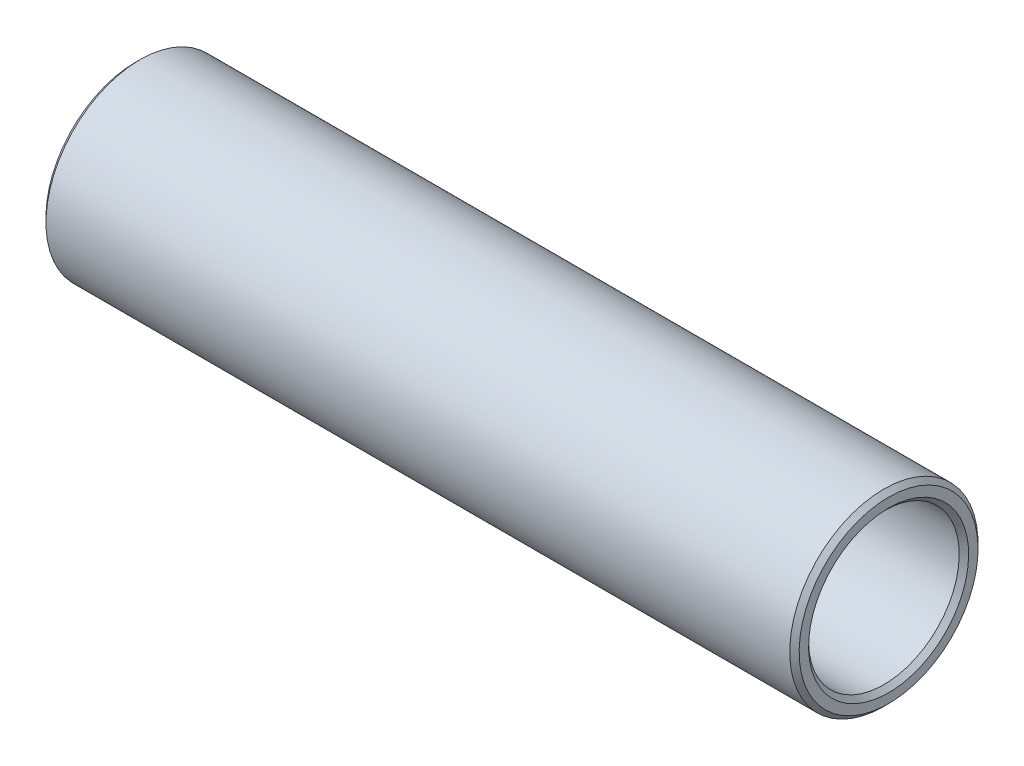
ISO-10303-21;
HEADER;
FILE_DESCRIPTION(('STEP AP214'),'2;1');
FILE_NAME('part.step','',(''),(''),'','','');
FILE_SCHEMA(('AUTOMOTIVE_DESIGN { 1 0 10303 214 1 1 1 1 }'));
ENDSEC;
DATA;
#1=APPLICATION_CONTEXT('core data for automotive mechanical design processes');
#2=APPLICATION_PROTOCOL_DEFINITION('international standard','automotive_design',2000,#1);
#3=PRODUCT_CONTEXT('',#1,'mechanical');
#4=PRODUCT('Part','Part','',(#3));
#5=PRODUCT_RELATED_PRODUCT_CATEGORY('part','',(#4));
#6=PRODUCT_DEFINITION_FORMATION('','',#4);
#7=PRODUCT_DEFINITION_CONTEXT('part definition',#1,'design');
#8=PRODUCT_DEFINITION('design','',#6,#7);
#9=PRODUCT_DEFINITION_SHAPE('','',#8);
#10=(LENGTH_UNIT() NAMED_UNIT(*) SI_UNIT(.MILLI.,.METRE.));
#11=(NAMED_UNIT(*) PLANE_ANGLE_UNIT() SI_UNIT($,.RADIAN.));
#12=(NAMED_UNIT(*) SI_UNIT($,.STERADIAN.) SOLID_ANGLE_UNIT());
#13=UNCERTAINTY_MEASURE_WITH_UNIT(LENGTH_MEASURE(1.E-05),#10,'distance_accuracy_value','');
#14=(GEOMETRIC_REPRESENTATION_CONTEXT(3) GLOBAL_UNCERTAINTY_ASSIGNED_CONTEXT((#13)) GLOBAL_UNIT_ASSIGNED_CONTEXT((#10,
#11,#12)) REPRESENTATION_CONTEXT('',''));
#15=CARTESIAN_POINT('',(0.,0.,0.));
#16=DIRECTION('',(0.,0.,1.));
#17=DIRECTION('',(1.,0.,0.));
#18=AXIS2_PLACEMENT_3D('',#15,#16,#17);
#19=CARTESIAN_POINT('',(10.3441887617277,2.,0.));
#20=DIRECTION('',(1.,0.,0.));
#21=DIRECTION('',(0.,0.,-1.));
#22=AXIS2_PLACEMENT_3D('',#19,#20,#21);
#23=PLANE('',#22);
#24=CARTESIAN_POINT('',(10.3441887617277,0.,0.));
#25=DIRECTION('',(-1.,0.,0.));
#26=DIRECTION('',(0.,0.,-1.));
#27=AXIS2_PLACEMENT_3D('',#24,#25,#26);
#28=CIRCLE('',#27,3.4);
#29=CARTESIAN_POINT('',(10.3441887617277,0.,-3.4));
#30=VERTEX_POINT('',#29);
#31=EDGE_CURVE('E9',#30,#30,#28,.T.);
#32=ORIENTED_EDGE('',*,*,#31,.T.);
#33=EDGE_LOOP('',(#32));
#34=FACE_BOUND('',#33,.T.);
#35=DIRECTION('',(0.,0.,-1.));
#36=VECTOR('',#35,1.);
#37=CARTESIAN_POINT('',(10.3441887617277,0.,-1.9875));
#38=LINE('',#37,#36);
#39=CARTESIAN_POINT('',(10.3441887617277,0.,-3.94999999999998));
#40=VERTEX_POINT('',#39);
#41=CARTESIAN_POINT('',(10.3441887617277,0.,-3.99999999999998));
#42=VERTEX_POINT('',#41);
#43=EDGE_CURVE('E25',#40,#42,#38,.T.);
#44=ORIENTED_EDGE('',*,*,#43,.T.);
#45=CARTESIAN_POINT('',(10.3441887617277,0.,0.));
#46=DIRECTION('',(1.,0.,0.));
#47=DIRECTION('',(0.,1.,0.));
#48=AXIS2_PLACEMENT_3D('',#45,#46,#47);
#49=CIRCLE('',#48,4.);
#50=CARTESIAN_POINT('',(10.3441887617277,4.00000000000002,0.));
#51=VERTEX_POINT('',#50);
#52=EDGE_CURVE('E100',#42,#51,#49,.T.);
#53=ORIENTED_EDGE('',*,*,#52,.T.);
#54=DIRECTION('',(0.,-1.,0.));
#55=VECTOR('',#54,1.);
#56=CARTESIAN_POINT('',(10.3441887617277,2.9875,0.));
#57=LINE('',#56,#55);
#58=CARTESIAN_POINT('',(10.3441887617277,3.95000000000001,0.));
#59=VERTEX_POINT('',#58);
#60=EDGE_CURVE('E169',#51,#59,#57,.T.);
#61=ORIENTED_EDGE('',*,*,#60,.T.);
#62=CARTESIAN_POINT('',(10.3441887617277,0.,0.));
#63=DIRECTION('',(1.,0.,0.));
#64=DIRECTION('',(0.,1.,0.));
#65=AXIS2_PLACEMENT_3D('',#62,#63,#64);
#66=CIRCLE('',#65,3.95);
#67=EDGE_CURVE('E165',#59,#40,#66,.T.);
#68=ORIENTED_EDGE('',*,*,#67,.T.);
#69=EDGE_LOOP('',(#44,#53,#61,#68));
#70=FACE_BOUND('',#69,.T.);
#71=ADVANCED_FACE('F14',(#34,#70),#23,.T.);
#72=DIRECTION('',(0.553133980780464,0.833092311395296,0.));
#73=VECTOR('',#72,1.);
#74=CARTESIAN_POINT('',(331320.14035199,499000.,-4.27435864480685E-12));
#75=LINE('',#74,#73);
#76=CARTESIAN_POINT('',(7.68837752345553,0.,0.));
#77=DIRECTION('',(1.,0.,0.));
#78=AXIS1_PLACEMENT('',#76,#77);
#79=SURFACE_OF_REVOLUTION('',#75,#78);
#80=CARTESIAN_POINT('',(10.3441887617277,0.,0.));
#81=DIRECTION('',(1.,0.,0.));
#82=DIRECTION('',(0.,1.,0.));
#83=AXIS2_PLACEMENT_3D('',#80,#81,#82);
#84=CIRCLE('',#83,4.);
#85=EDGE_CURVE('E96',#51,#42,#84,.T.);
#86=ORIENTED_EDGE('',*,*,#85,.F.);
#87=ORIENTED_EDGE('',*,*,#52,.F.);
#88=EDGE_LOOP('',(#86,#87));
#89=FACE_BOUND('',#88,.T.);
#90=CARTESIAN_POINT('',(13.,0.,0.));
#91=DIRECTION('',(1.,0.,0.));
#92=DIRECTION('',(0.,1.,0.));
#93=AXIS2_PLACEMENT_3D('',#90,#91,#92);
#94=CIRCLE('',#93,8.);
#95=CARTESIAN_POINT('',(13.,8.,0.));
#96=VERTEX_POINT('',#95);
#97=EDGE_CURVE('E92',#96,#96,#94,.T.);
#98=ORIENTED_EDGE('',*,*,#97,.T.);
#99=EDGE_LOOP('',(#98));
#100=FACE_BOUND('',#99,.T.);
#101=ADVANCED_FACE('F111',(#89,#100),#79,.F.);
#102=CARTESIAN_POINT('',(46.25,0.,0.));
#103=DIRECTION('',(-1.,0.,0.));
#104=DIRECTION('',(0.,0.,1.));
#105=AXIS2_PLACEMENT_3D('',#102,#103,#104);
#106=CYLINDRICAL_SURFACE('',#105,8.);
#107=ORIENTED_EDGE('',*,*,#97,.F.);
#108=EDGE_LOOP('',(#107));
#109=FACE_BOUND('',#108,.T.);
#110=CARTESIAN_POINT('',(79.5,0.,0.));
#111=DIRECTION('',(1.,0.,0.));
#112=DIRECTION('',(0.,1.,0.));
#113=AXIS2_PLACEMENT_3D('',#110,#111,#112);
#114=CIRCLE('',#113,8.);
#115=CARTESIAN_POINT('',(79.5,8.,0.));
#116=VERTEX_POINT('',#115);
#117=EDGE_CURVE('E87',#116,#116,#114,.T.);
#118=ORIENTED_EDGE('',*,*,#117,.T.);
#119=EDGE_LOOP('',(#118));
#120=FACE_BOUND('',#119,.T.);
#121=ADVANCED_FACE('F115',(#109,#120),#106,.F.);
#122=DIRECTION('',(0.707106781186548,0.707106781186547,0.));
#123=VECTOR('',#122,1.);
#124=CARTESIAN_POINT('',(79.75,8.24999999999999,0.));
#125=LINE('',#124,#123);
#126=CARTESIAN_POINT('',(71.5,0.,0.));
#127=DIRECTION('',(1.,0.,0.));
#128=AXIS1_PLACEMENT('',#126,#127);
#129=SURFACE_OF_REVOLUTION('',#125,#128);
#130=ORIENTED_EDGE('',*,*,#117,.F.);
#131=EDGE_LOOP('',(#130));
#132=FACE_BOUND('',#131,.T.);
#133=CARTESIAN_POINT('',(80.0000000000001,0.,0.));
#134=DIRECTION('',(1.,0.,0.));
#135=DIRECTION('',(0.,1.,0.));
#136=AXIS2_PLACEMENT_3D('',#133,#134,#135);
#137=CIRCLE('',#136,8.5);
#138=CARTESIAN_POINT('',(80.0000000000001,8.5,0.));
#139=VERTEX_POINT('',#138);
#140=EDGE_CURVE('E175',#139,#139,#137,.T.);
#141=ORIENTED_EDGE('',*,*,#140,.T.);
#142=EDGE_LOOP('',(#141));
#143=FACE_BOUND('',#142,.T.);
#144=ADVANCED_FACE('F117',(#132,#143),#129,.F.);
#145=CARTESIAN_POINT('',(80.0000000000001,9.00000000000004,0.));
#146=DIRECTION('',(1.,0.,0.));
#147=DIRECTION('',(0.,0.,-1.));
#148=AXIS2_PLACEMENT_3D('',#145,#146,#147);
#149=PLANE('',#148);
#150=CARTESIAN_POINT('',(80.0000000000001,0.,0.));
#151=DIRECTION('',(1.,0.,0.));
#152=DIRECTION('',(0.,1.,0.));
#153=AXIS2_PLACEMENT_3D('',#150,#151,#152);
#154=CIRCLE('',#153,9.5);
#155=CARTESIAN_POINT('',(80.0000000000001,9.5,0.));
#156=VERTEX_POINT('',#155);
#157=EDGE_CURVE('E179',#156,#156,#154,.T.);
#158=ORIENTED_EDGE('',*,*,#157,.T.);
#159=EDGE_LOOP('',(#158));
#160=FACE_BOUND('',#159,.T.);
#161=ORIENTED_EDGE('',*,*,#140,.F.);
#162=EDGE_LOOP('',(#161));
#163=FACE_BOUND('',#162,.T.);
#164=ADVANCED_FACE('F120',(#160,#163),#149,.T.);
#165=DIRECTION('',(0.707106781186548,-0.707106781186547,0.));
#166=VECTOR('',#165,1.);
#167=CARTESIAN_POINT('',(79.75,9.75000000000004,0.));
#168=LINE('',#167,#166);
#169=CARTESIAN_POINT('',(89.5,0.,0.));
#170=DIRECTION('',(-1.,0.,0.));
#171=AXIS1_PLACEMENT('',#169,#170);
#172=SURFACE_OF_REVOLUTION('',#168,#171);
#173=CARTESIAN_POINT('',(79.5,0.,0.));
#174=DIRECTION('',(1.,0.,0.));
#175=DIRECTION('',(0.,1.,0.));
#176=AXIS2_PLACEMENT_3D('',#173,#174,#175);
#177=CIRCLE('',#176,10.);
#178=CARTESIAN_POINT('',(79.5,10.,0.));
#179=VERTEX_POINT('',#178);
#180=EDGE_CURVE('E91',#179,#179,#177,.T.);
#181=ORIENTED_EDGE('',*,*,#180,.T.);
#182=EDGE_LOOP('',(#181));
#183=FACE_BOUND('',#182,.T.);
#184=ORIENTED_EDGE('',*,*,#157,.F.);
#185=EDGE_LOOP('',(#184));
#186=FACE_BOUND('',#185,.T.);
#187=ADVANCED_FACE('F124',(#183,#186),#172,.F.);
#188=CARTESIAN_POINT('',(40.,0.,0.));
#189=DIRECTION('',(-1.,0.,0.));
#190=DIRECTION('',(0.,0.,1.));
#191=AXIS2_PLACEMENT_3D('',#188,#189,#190);
#192=CYLINDRICAL_SURFACE('',#191,10.);
#193=CARTESIAN_POINT('',(0.499999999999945,0.,0.));
#194=DIRECTION('',(1.,0.,0.));
#195=DIRECTION('',(0.,1.,0.));
#196=AXIS2_PLACEMENT_3D('',#193,#194,#195);
#197=CIRCLE('',#196,10.);
#198=CARTESIAN_POINT('',(0.499999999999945,10.,0.));
#199=VERTEX_POINT('',#198);
#200=EDGE_CURVE('E93',#199,#199,#197,.T.);
#201=ORIENTED_EDGE('',*,*,#200,.T.);
#202=EDGE_LOOP('',(#201));
#203=FACE_BOUND('',#202,.T.);
#204=ORIENTED_EDGE('',*,*,#180,.F.);
#205=EDGE_LOOP('',(#204));
#206=FACE_BOUND('',#205,.T.);
#207=ADVANCED_FACE('F128',(#203,#206),#192,.T.);
#208=DIRECTION('',(-0.707106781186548,-0.707106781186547,0.));
#209=VECTOR('',#208,1.);
#210=CARTESIAN_POINT('',(0.249999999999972,9.75000000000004,0.));
#211=LINE('',#210,#209);
#212=CARTESIAN_POINT('',(-9.50000000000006,0.,0.));
#213=DIRECTION('',(1.,0.,0.));
#214=AXIS1_PLACEMENT('',#212,#213);
#215=SURFACE_OF_REVOLUTION('',#211,#214);
#216=CARTESIAN_POINT('',(0.,0.,0.));
#217=DIRECTION('',(1.,0.,0.));
#218=DIRECTION('',(0.,1.,0.));
#219=AXIS2_PLACEMENT_3D('',#216,#217,#218);
#220=CIRCLE('',#219,9.5);
#221=CARTESIAN_POINT('',(0.,9.5,0.));
#222=VERTEX_POINT('',#221);
#223=EDGE_CURVE('E186',#222,#222,#220,.T.);
#224=ORIENTED_EDGE('',*,*,#223,.T.);
#225=EDGE_LOOP('',(#224));
#226=FACE_BOUND('',#225,.T.);
#227=ORIENTED_EDGE('',*,*,#200,.F.);
#228=EDGE_LOOP('',(#227));
#229=FACE_BOUND('',#228,.T.);
#230=ADVANCED_FACE('F133',(#226,#229),#215,.F.);
#231=CARTESIAN_POINT('',(0.,4.75000000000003,0.));
#232=DIRECTION('',(-1.,0.,0.));
#233=DIRECTION('',(0.,0.,1.));
#234=AXIS2_PLACEMENT_3D('',#231,#232,#233);
#235=PLANE('',#234);
#236=ORIENTED_EDGE('',*,*,#223,.F.);
#237=EDGE_LOOP('',(#236));
#238=FACE_BOUND('',#237,.T.);
#239=CARTESIAN_POINT('',(0.,0.,0.));
#240=DIRECTION('',(1.,0.,0.));
#241=DIRECTION('',(0.,0.,-1.));
#242=AXIS2_PLACEMENT_3D('',#239,#240,#241);
#243=CIRCLE('',#242,3.4);
#244=CARTESIAN_POINT('',(0.,0.,-3.4));
#245=VERTEX_POINT('',#244);
#246=EDGE_CURVE('E72',#245,#245,#243,.T.);
#247=ORIENTED_EDGE('',*,*,#246,.T.);
#248=EDGE_LOOP('',(#247));
#249=FACE_BOUND('',#248,.T.);
#250=CARTESIAN_POINT('',(0.,0.,0.));
#251=DIRECTION('',(-1.,0.,0.));
#252=DIRECTION('',(0.,1.,0.));
#253=AXIS2_PLACEMENT_3D('',#250,#251,#252);
#254=CIRCLE('',#253,3.95);
#255=CARTESIAN_POINT('',(0.,0.,-3.94999999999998));
#256=VERTEX_POINT('',#255);
#257=CARTESIAN_POINT('',(0.,3.95000000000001,0.));
#258=VERTEX_POINT('',#257);
#259=EDGE_CURVE('E57',#256,#258,#254,.T.);
#260=ORIENTED_EDGE('',*,*,#259,.T.);
#261=DIRECTION('',(0.,1.,0.));
#262=VECTOR('',#261,1.);
#263=CARTESIAN_POINT('',(0.,4.36249999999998,0.));
#264=LINE('',#263,#262);
#265=CARTESIAN_POINT('',(0.,4.00000000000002,0.));
#266=VERTEX_POINT('',#265);
#267=EDGE_CURVE('E73',#258,#266,#264,.T.);
#268=ORIENTED_EDGE('',*,*,#267,.T.);
#269=CARTESIAN_POINT('',(0.,0.,0.));
#270=DIRECTION('',(1.,0.,0.));
#271=DIRECTION('',(0.,1.,0.));
#272=AXIS2_PLACEMENT_3D('',#269,#270,#271);
#273=CIRCLE('',#272,4.);
#274=CARTESIAN_POINT('',(0.,0.,-3.99999999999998));
#275=VERTEX_POINT('',#274);
#276=EDGE_CURVE('E59',#266,#275,#273,.T.);
#277=ORIENTED_EDGE('',*,*,#276,.T.);
#278=DIRECTION('',(0.,0.,1.));
#279=VECTOR('',#278,1.);
#280=CARTESIAN_POINT('',(0.,0.,-1.9875));
#281=LINE('',#280,#279);
#282=EDGE_CURVE('E53',#275,#256,#281,.T.);
#283=ORIENTED_EDGE('',*,*,#282,.T.);
#284=EDGE_LOOP('',(#260,#268,#277,#283));
#285=FACE_BOUND('',#284,.T.);
#286=ADVANCED_FACE('F55',(#238,#249,#285),#235,.T.);
#287=CARTESIAN_POINT('',(6.49999999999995,0.,0.));
#288=DIRECTION('',(-1.,0.,0.));
#289=DIRECTION('',(0.,0.,1.));
#290=AXIS2_PLACEMENT_3D('',#287,#288,#289);
#291=CYLINDRICAL_SURFACE('',#290,3.4);
#292=ORIENTED_EDGE('',*,*,#31,.F.);
#293=EDGE_LOOP('',(#292));
#294=FACE_BOUND('',#293,.T.);
#295=ORIENTED_EDGE('',*,*,#246,.F.);
#296=EDGE_LOOP('',(#295));
#297=FACE_BOUND('',#296,.T.);
#298=ADVANCED_FACE('F140',(#294,#297),#291,.F.);
#299=CARTESIAN_POINT('',(6.49999999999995,0.,-3.97499999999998));
#300=DIRECTION('',(0.,-1.,0.));
#301=DIRECTION('',(0.,0.,-1.));
#302=AXIS2_PLACEMENT_3D('',#299,#300,#301);
#303=PLANE('',#302);
#304=ORIENTED_EDGE('',*,*,#43,.F.);
#305=DIRECTION('',(-1.,0.,0.));
#306=VECTOR('',#305,1.);
#307=CARTESIAN_POINT('',(0.,0.,-3.94999999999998));
#308=LINE('',#307,#306);
#309=EDGE_CURVE('E62',#40,#256,#308,.T.);
#310=ORIENTED_EDGE('',*,*,#309,.T.);
#311=ORIENTED_EDGE('',*,*,#282,.F.);
#312=DIRECTION('',(1.,0.,0.));
#313=VECTOR('',#312,1.);
#314=CARTESIAN_POINT('',(13.,0.,-3.99999999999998));
#315=LINE('',#314,#313);
#316=EDGE_CURVE('E33',#275,#42,#315,.T.);
#317=ORIENTED_EDGE('',*,*,#316,.T.);
#318=EDGE_LOOP('',(#304,#310,#311,#317));
#319=FACE_BOUND('',#318,.T.);
#320=ADVANCED_FACE('F75',(#319),#303,.T.);
#321=CARTESIAN_POINT('',(6.49999999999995,0.,0.));
#322=DIRECTION('',(-1.,0.,0.));
#323=DIRECTION('',(0.,0.,1.));
#324=AXIS2_PLACEMENT_3D('',#321,#322,#323);
#325=CYLINDRICAL_SURFACE('',#324,3.95);
#326=DIRECTION('',(1.,0.,0.));
#327=VECTOR('',#326,1.);
#328=CARTESIAN_POINT('',(0.,3.95000000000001,0.));
#329=LINE('',#328,#327);
#330=EDGE_CURVE('E69',#258,#59,#329,.T.);
#331=ORIENTED_EDGE('',*,*,#330,.F.);
#332=ORIENTED_EDGE('',*,*,#259,.F.);
#333=ORIENTED_EDGE('',*,*,#309,.F.);
#334=ORIENTED_EDGE('',*,*,#67,.F.);
#335=EDGE_LOOP('',(#331,#332,#333,#334));
#336=FACE_BOUND('',#335,.T.);
#337=ADVANCED_FACE('F66',(#336),#325,.T.);
#338=CARTESIAN_POINT('',(6.49999999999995,3.97500000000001,0.));
#339=DIRECTION('',(0.,0.,1.));
#340=DIRECTION('',(1.,0.,0.));
#341=AXIS2_PLACEMENT_3D('',#338,#339,#340);
#342=PLANE('',#341);
#343=ORIENTED_EDGE('',*,*,#60,.F.);
#344=DIRECTION('',(-1.,0.,0.));
#345=VECTOR('',#344,1.);
#346=CARTESIAN_POINT('',(13.,4.00000000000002,0.));
#347=LINE('',#346,#345);
#348=EDGE_CURVE('E83',#51,#266,#347,.T.);
#349=ORIENTED_EDGE('',*,*,#348,.T.);
#350=ORIENTED_EDGE('',*,*,#267,.F.);
#351=ORIENTED_EDGE('',*,*,#330,.T.);
#352=EDGE_LOOP('',(#343,#349,#350,#351));
#353=FACE_BOUND('',#352,.T.);
#354=ADVANCED_FACE('F146',(#353),#342,.T.);
#355=CARTESIAN_POINT('',(6.49999999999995,0.,0.));
#356=DIRECTION('',(-1.,0.,0.));
#357=DIRECTION('',(0.,0.,1.));
#358=AXIS2_PLACEMENT_3D('',#355,#356,#357);
#359=CYLINDRICAL_SURFACE('',#358,4.);
#360=ORIENTED_EDGE('',*,*,#316,.F.);
#361=ORIENTED_EDGE('',*,*,#276,.F.);
#362=ORIENTED_EDGE('',*,*,#348,.F.);
#363=ORIENTED_EDGE('',*,*,#85,.T.);
#364=EDGE_LOOP('',(#360,#361,#362,#363));
#365=FACE_BOUND('',#364,.T.);
#366=ADVANCED_FACE('F16',(#365),#359,.F.);
#367=CLOSED_SHELL('',(#71,#101,#121,#144,#164,#187,#207,#230,#286,#298,#320,#337,#354,#366));
#368=MANIFOLD_SOLID_BREP('B1',#367);
#369=ADVANCED_BREP_SHAPE_REPRESENTATION('',(#18,#368),#14);
#370=SHAPE_DEFINITION_REPRESENTATION(#9,#369);
ENDSEC;
END-ISO-10303-21;
